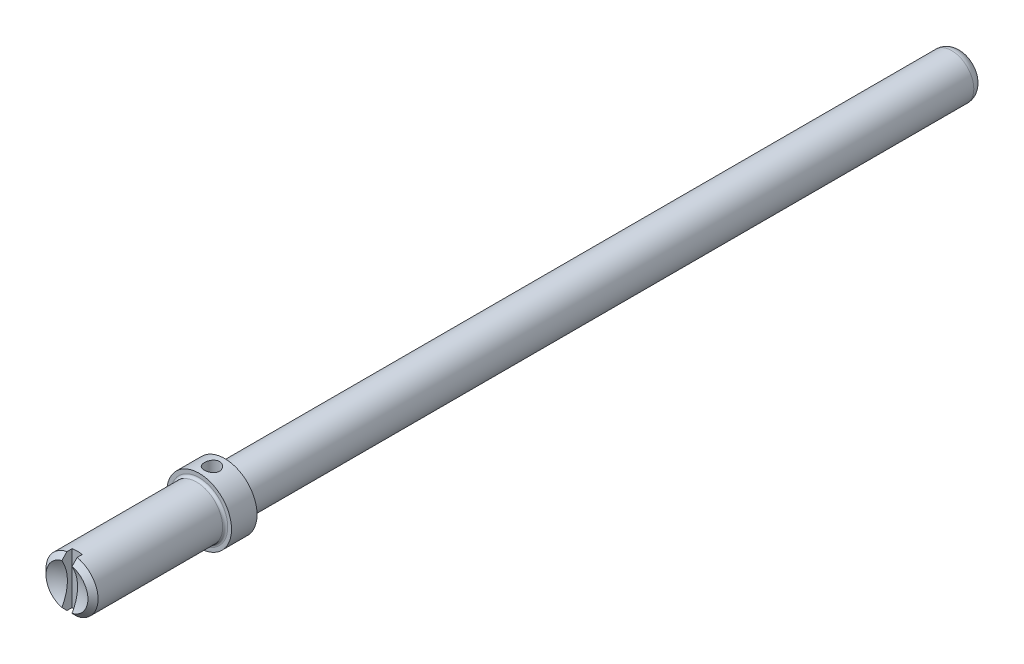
ISO-10303-21;
HEADER;
FILE_DESCRIPTION(('STEP AP214'),'2;1');
FILE_NAME('part.step','',(''),(''),'','','');
FILE_SCHEMA(('AUTOMOTIVE_DESIGN { 1 0 10303 214 1 1 1 1 }'));
ENDSEC;
DATA;
#1=APPLICATION_CONTEXT('core data for automotive mechanical design processes');
#2=APPLICATION_PROTOCOL_DEFINITION('international standard','automotive_design',2000,#1);
#3=PRODUCT_CONTEXT('',#1,'mechanical');
#4=PRODUCT('Part','Part','',(#3));
#5=PRODUCT_RELATED_PRODUCT_CATEGORY('part','',(#4));
#6=PRODUCT_DEFINITION_FORMATION('','',#4);
#7=PRODUCT_DEFINITION_CONTEXT('part definition',#1,'design');
#8=PRODUCT_DEFINITION('design','',#6,#7);
#9=PRODUCT_DEFINITION_SHAPE('','',#8);
#10=(LENGTH_UNIT() NAMED_UNIT(*) SI_UNIT(.MILLI.,.METRE.));
#11=(NAMED_UNIT(*) PLANE_ANGLE_UNIT() SI_UNIT($,.RADIAN.));
#12=(NAMED_UNIT(*) SI_UNIT($,.STERADIAN.) SOLID_ANGLE_UNIT());
#13=UNCERTAINTY_MEASURE_WITH_UNIT(LENGTH_MEASURE(1.E-05),#10,'distance_accuracy_value','');
#14=(GEOMETRIC_REPRESENTATION_CONTEXT(3) GLOBAL_UNCERTAINTY_ASSIGNED_CONTEXT((#13)) GLOBAL_UNIT_ASSIGNED_CONTEXT((#10,
#11,#12)) REPRESENTATION_CONTEXT('',''));
#15=CARTESIAN_POINT('',(0.,0.,0.));
#16=DIRECTION('',(0.,0.,1.));
#17=DIRECTION('',(1.,0.,0.));
#18=AXIS2_PLACEMENT_3D('',#15,#16,#17);
#19=CARTESIAN_POINT('',(0.,0.,0.113092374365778));
#20=DIRECTION('',(0.,0.,-1.));
#21=DIRECTION('',(-1.,0.,0.));
#22=AXIS2_PLACEMENT_3D('',#19,#20,#21);
#23=CONICAL_SURFACE('',#22,4.064,0.78539816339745);
#24=CARTESIAN_POINT('',(0.,0.,0.113092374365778));
#25=DIRECTION('',(0.,0.,1.));
#26=DIRECTION('',(1.,0.,0.));
#27=AXIS2_PLACEMENT_3D('',#24,#25,#26);
#28=CIRCLE('',#27,4.064);
#29=CARTESIAN_POINT('',(-0.79375,3.98573166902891,0.113092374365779));
#30=VERTEX_POINT('',#29);
#31=CARTESIAN_POINT('',(-0.79375,-3.98573166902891,0.113092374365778));
#32=VERTEX_POINT('',#31);
#33=EDGE_CURVE('E101',#30,#32,#28,.T.);
#34=ORIENTED_EDGE('',*,*,#33,.T.);
#35=CARTESIAN_POINT('',(-0.793749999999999,-8.92898810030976,-4.78710684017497));
#36=CARTESIAN_POINT('',(-0.793749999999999,-8.60900897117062,-4.46839600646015));
#37=CARTESIAN_POINT('',(-0.79375,-8.28897340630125,-4.14974175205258));
#38=CARTESIAN_POINT('',(-0.79375,-7.64868890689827,-3.51260359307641));
#39=CARTESIAN_POINT('',(-0.79375,-7.32843995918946,-3.19411970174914));
#40=CARTESIAN_POINT('',(-0.79375,-6.68714460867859,-2.55689909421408));
#41=CARTESIAN_POINT('',(-0.79375,-6.36609776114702,-2.2381628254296));
#42=CARTESIAN_POINT('',(-0.79375,-5.72360429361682,-1.60113642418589));
#43=CARTESIAN_POINT('',(-0.79375,-5.40215770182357,-1.28284626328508));
#44=CARTESIAN_POINT('',(-0.79375,-4.7791272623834,-0.667274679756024));
#45=CARTESIAN_POINT('',(-0.79375,-4.47758622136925,-0.369949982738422));
#46=CARTESIAN_POINT('',(-0.79375,-4.02442427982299,0.0752327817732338));
#47=CARTESIAN_POINT('',(-0.79375,-3.87321327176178,0.223507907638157));
#48=CARTESIAN_POINT('',(-0.79375,-3.57040511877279,0.519657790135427));
#49=CARTESIAN_POINT('',(-0.79375,-3.4188079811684,0.667532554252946));
#50=CARTESIAN_POINT('',(-0.79375,-3.11519891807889,0.962560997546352));
#51=CARTESIAN_POINT('',(-0.79375,-2.96318753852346,1.10971523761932));
#52=CARTESIAN_POINT('',(-0.79375,-2.65828988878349,1.40313706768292));
#53=CARTESIAN_POINT('',(-0.79375,-2.50540355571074,1.54940459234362));
#54=CARTESIAN_POINT('',(-0.79375,-2.19828604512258,1.840421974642));
#55=CARTESIAN_POINT('',(-0.79375,-2.04405535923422,1.9851723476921));
#56=CARTESIAN_POINT('',(-0.79375,-1.81078801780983,2.20019823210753));
#57=CARTESIAN_POINT('',(-0.79375,-1.73271661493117,2.27151949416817));
#58=CARTESIAN_POINT('',(-0.79375,-1.57564988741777,2.41313597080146));
#59=CARTESIAN_POINT('',(-0.79375,-1.49665460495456,2.48343123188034));
#60=CARTESIAN_POINT('',(-0.79375,-1.39468587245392,2.57238940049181));
#61=CARTESIAN_POINT('',(-0.79375,-1.37234208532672,2.59177431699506));
#62=CARTESIAN_POINT('',(-0.79375,-1.32753176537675,2.6304022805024));
#63=CARTESIAN_POINT('',(-0.79375,-1.30506523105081,2.64964532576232));
#64=CARTESIAN_POINT('',(-0.79375,-1.23745552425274,2.70713625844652));
#65=CARTESIAN_POINT('',(-0.79375,-1.19210609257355,2.74514257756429));
#66=CARTESIAN_POINT('',(-0.79375,-1.10017286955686,2.82072745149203));
#67=CARTESIAN_POINT('',(-0.793750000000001,-1.05358088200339,2.85829607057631));
#68=CARTESIAN_POINT('',(-0.793750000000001,-0.959449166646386,2.93221041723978));
#69=CARTESIAN_POINT('',(-0.793750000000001,-0.911909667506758,2.96855643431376));
#70=CARTESIAN_POINT('',(-0.793750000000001,-0.814905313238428,3.0399842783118));
#71=CARTESIAN_POINT('',(-0.793750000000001,-0.765423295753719,3.07504298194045));
#72=CARTESIAN_POINT('',(-0.793750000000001,-0.664577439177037,3.14254205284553));
#73=CARTESIAN_POINT('',(-0.793750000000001,-0.61321116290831,3.17497884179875));
#74=CARTESIAN_POINT('',(-0.793750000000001,-0.508651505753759,3.23530980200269));
#75=CARTESIAN_POINT('',(-0.793750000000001,-0.455487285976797,3.26325361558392));
#76=CARTESIAN_POINT('',(-0.793750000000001,-0.346184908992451,3.31249518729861));
#77=CARTESIAN_POINT('',(-0.793750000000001,-0.290057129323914,3.33381454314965));
#78=CARTESIAN_POINT('',(-0.793750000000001,-0.205980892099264,3.35744541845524));
#79=CARTESIAN_POINT('',(-0.793750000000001,-0.17917287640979,3.36380563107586));
#80=CARTESIAN_POINT('',(-0.793750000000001,-0.125071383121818,3.37398782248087));
#81=CARTESIAN_POINT('',(-0.793750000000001,-0.0977779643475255,3.37781010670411));
#82=CARTESIAN_POINT('',(-0.793750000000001,-0.043035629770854,3.38264169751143));
#83=CARTESIAN_POINT('',(-0.793750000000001,-0.0155876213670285,3.38366103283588));
#84=CARTESIAN_POINT('',(-0.793750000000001,0.0392602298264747,3.38284722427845));
#85=CARTESIAN_POINT('',(-0.793750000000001,0.0666600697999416,3.38101391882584));
#86=CARTESIAN_POINT('',(-0.793750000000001,0.147983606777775,3.37144138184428));
#87=CARTESIAN_POINT('',(-0.793750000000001,0.201462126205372,3.35966460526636));
#88=CARTESIAN_POINT('',(-0.793750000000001,0.279799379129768,3.33584980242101));
#89=CARTESIAN_POINT('',(-0.793750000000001,0.305683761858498,3.32684507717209));
#90=CARTESIAN_POINT('',(-0.793750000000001,0.356805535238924,3.30715121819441));
#91=CARTESIAN_POINT('',(-0.793750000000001,0.382043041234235,3.29646238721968));
#92=CARTESIAN_POINT('',(-0.793750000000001,0.453919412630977,3.26367776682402));
#93=CARTESIAN_POINT('',(-0.793750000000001,0.499761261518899,3.2398490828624));
#94=CARTESIAN_POINT('',(-0.793750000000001,0.589649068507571,3.18898605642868));
#95=CARTESIAN_POINT('',(-0.793750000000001,0.633692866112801,3.16194800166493));
#96=CARTESIAN_POINT('',(-0.793750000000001,0.72051132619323,3.10560663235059));
#97=CARTESIAN_POINT('',(-0.793750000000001,0.763281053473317,3.07629578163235));
#98=CARTESIAN_POINT('',(-0.793750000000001,0.847731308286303,3.01613807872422));
#99=CARTESIAN_POINT('',(-0.793750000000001,0.889411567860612,2.98529085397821));
#100=CARTESIAN_POINT('',(-0.793750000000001,1.01399754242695,2.89051862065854));
#101=CARTESIAN_POINT('',(-0.79375,1.09562742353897,2.82492159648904));
#102=CARTESIAN_POINT('',(-0.79375,1.21642156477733,2.72477133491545));
#103=CARTESIAN_POINT('',(-0.79375,1.25636516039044,2.69113603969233));
#104=CARTESIAN_POINT('',(-0.79375,1.33583062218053,2.62337187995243));
#105=CARTESIAN_POINT('',(-0.79375,1.37535250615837,2.58924303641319));
#106=CARTESIAN_POINT('',(-0.79375,1.49170376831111,2.48777476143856));
#107=CARTESIAN_POINT('',(-0.79375,1.56805956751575,2.41989356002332));
#108=CARTESIAN_POINT('',(-0.79375,1.71989401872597,2.28315505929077));
#109=CARTESIAN_POINT('',(-0.79375,1.79537263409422,2.21429771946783));
#110=CARTESIAN_POINT('',(-0.79375,2.02090172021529,2.00670485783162));
#111=CARTESIAN_POINT('',(-0.79375,2.17002653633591,1.86696527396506));
#112=CARTESIAN_POINT('',(-0.79375,2.46709271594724,1.58588992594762));
#113=CARTESIAN_POINT('',(-0.79375,2.61503245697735,1.4445524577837));
#114=CARTESIAN_POINT('',(-0.79375,2.91005209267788,1.16100501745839));
#115=CARTESIAN_POINT('',(-0.79375,3.05713204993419,1.01879511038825));
#116=CARTESIAN_POINT('',(-0.79375,3.34938945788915,0.735111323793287));
#117=CARTESIAN_POINT('',(-0.79375,3.494571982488,0.593642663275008));
#118=CARTESIAN_POINT('',(-0.79375,3.78455928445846,0.310313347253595));
#119=CARTESIAN_POINT('',(-0.79375,3.92936405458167,0.168452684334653));
#120=CARTESIAN_POINT('',(-0.79375,4.36324671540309,-0.257416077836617));
#121=CARTESIAN_POINT('',(-0.79375,4.65192075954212,-0.541835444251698));
#122=CARTESIAN_POINT('',(-0.79375,5.27203658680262,-1.15410662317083));
#123=CARTESIAN_POINT('',(-0.79375,5.60338083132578,-1.48205710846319));
#124=CARTESIAN_POINT('',(-0.79375,6.26564923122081,-2.13848281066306));
#125=CARTESIAN_POINT('',(-0.79375,6.59657331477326,-2.46695810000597));
#126=CARTESIAN_POINT('',(-0.79375,7.26122311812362,-3.12728638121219));
#127=CARTESIAN_POINT('',(-0.79375,7.59494604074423,-3.4591421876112));
#128=CARTESIAN_POINT('',(-0.79375,8.26212859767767,-4.12301430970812));
#129=CARTESIAN_POINT('',(-0.79375,8.59558826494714,-4.455030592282));
#130=CARTESIAN_POINT('',(-0.793749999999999,8.92898810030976,-4.78710684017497));
#131=B_SPLINE_CURVE_WITH_KNOTS('',3,(#35,#36,#37,#38,#39,#40,#41,#42,#43,#44,#45,#46,#47,#48,
#49,#50,#51,#52,#53,#54,#55,#56,#57,#58,#59,#60,#61,#62,#63,#64,#65,#66,#67,#68,#69,#70,#71,#72,
#73,#74,#75,#76,#77,#78,#79,#80,#81,#82,#83,#84,#85,#86,#87,#88,#89,#90,#91,#92,#93,#94,#95,#96,
#97,#98,#99,#100,#101,#102,#103,#104,#105,#106,#107,#108,#109,#110,#111,#112,#113,#114,#115,
#116,#117,#118,#119,#120,#121,#122,#123,#124,#125,#126,#127,#128,#129,#130),.UNSPECIFIED.,.F.,
.F.,(4,2,2,2,2,2,2,2,2,2,2,2,2,2,2,2,2,2,2,2,2,2,2,2,2,2,2,2,2,2,2,2,2,2,2,2,2,2,2,2,2,2,2,2,2,
2,2,4),(0.,1.35486875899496,2.70983081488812,4.06702432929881,5.42412697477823,6.69454262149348,
7.32987864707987,7.9652027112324,8.59990966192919,9.23466282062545,9.86919285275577,
10.186420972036,10.5036346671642,10.5923763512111,10.6811191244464,10.8586199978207,
11.0381607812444,11.2176587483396,11.3995344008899,11.5816542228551,11.7615981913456,
11.9409491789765,12.0235036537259,12.1060481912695,12.1882970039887,12.2705504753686,
12.4337851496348,12.5159673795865,12.5981348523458,12.7529164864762,12.9078789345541,
13.0633791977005,13.2189173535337,13.5329681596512,13.689625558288,13.8462763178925,
14.1527632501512,14.4592629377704,15.0723381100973,15.6861440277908,16.2999046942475,
16.9080338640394,17.5161746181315,18.7319208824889,20.1305141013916,21.5293207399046,
22.941231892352,24.3529227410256),.UNSPECIFIED.);
#132=CARTESIAN_POINT('',(-0.79375,-3.17245898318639,0.906842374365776));
#133=VERTEX_POINT('',#132);
#134=EDGE_CURVE('E60',#32,#133,#131,.T.);
#135=ORIENTED_EDGE('',*,*,#134,.T.);
#136=CARTESIAN_POINT('',(0.,0.,0.906842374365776));
#137=DIRECTION('',(0.,0.,1.));
#138=DIRECTION('',(1.,0.,0.));
#139=AXIS2_PLACEMENT_3D('',#136,#137,#138);
#140=CIRCLE('',#139,3.27025);
#141=CARTESIAN_POINT('',(-0.79375,3.17245898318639,0.906842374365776));
#142=VERTEX_POINT('',#141);
#143=EDGE_CURVE('E99',#142,#133,#140,.T.);
#144=ORIENTED_EDGE('',*,*,#143,.F.);
#145=EDGE_CURVE('E92',#142,#30,#131,.T.);
#146=ORIENTED_EDGE('',*,*,#145,.T.);
#147=EDGE_LOOP('',(#34,#135,#144,#146));
#148=FACE_BOUND('',#147,.T.);
#149=ADVANCED_FACE('F37',(#148),#23,.T.);
#150=CARTESIAN_POINT('',(0.,0.,6.35));
#151=DIRECTION('',(0.,0.,1.));
#152=DIRECTION('',(0.,1.,0.));
#153=AXIS2_PLACEMENT_3D('',#150,#151,#152);
#154=SPHERICAL_SURFACE('',#153,6.35);
#155=ORIENTED_EDGE('',*,*,#143,.T.);
#156=CARTESIAN_POINT('',(-0.793750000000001,0.,6.35));
#157=DIRECTION('',(-1.,0.,0.));
#158=DIRECTION('',(0.,0.,1.));
#159=AXIS2_PLACEMENT_3D('',#156,#157,#158);
#160=CIRCLE('',#159,6.30019530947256);
#161=EDGE_CURVE('E88',#133,#142,#160,.F.);
#162=ORIENTED_EDGE('',*,*,#161,.T.);
#163=EDGE_LOOP('',(#155,#162));
#164=FACE_BOUND('',#163,.T.);
#165=ADVANCED_FACE('F104',(#164),#154,.F.);
#166=CARTESIAN_POINT('',(0.,1.86689999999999,-138.793157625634));
#167=DIRECTION('',(0.,0.,1.));
#168=DIRECTION('',(1.,0.,0.));
#169=AXIS2_PLACEMENT_3D('',#166,#167,#168);
#170=PLANE('',#169);
#171=CARTESIAN_POINT('',(0.,0.,-138.793157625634));
#172=DIRECTION('',(0.,0.,1.));
#173=DIRECTION('',(1.,0.,0.));
#174=AXIS2_PLACEMENT_3D('',#171,#172,#173);
#175=CIRCLE('',#174,1.86689999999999);
#176=CARTESIAN_POINT('',(1.86689999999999,0.,-138.793157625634));
#177=VERTEX_POINT('',#176);
#178=EDGE_CURVE('E137',#177,#177,#175,.T.);
#179=ORIENTED_EDGE('',*,*,#178,.F.);
#180=EDGE_LOOP('',(#179));
#181=FACE_BOUND('',#180,.T.);
#182=ADVANCED_FACE('F39',(#181),#170,.F.);
#183=CARTESIAN_POINT('',(0.,0.,-137.205657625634));
#184=DIRECTION('',(0.,0.,1.));
#185=DIRECTION('',(1.,0.,0.));
#186=AXIS2_PLACEMENT_3D('',#183,#184,#185);
#187=TOROIDAL_SURFACE('',#186,1.8669,1.5875);
#188=CARTESIAN_POINT('',(0.,0.,-137.205657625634));
#189=DIRECTION('',(0.,0.,1.));
#190=DIRECTION('',(1.,0.,0.));
#191=AXIS2_PLACEMENT_3D('',#188,#189,#190);
#192=CIRCLE('',#191,3.4544);
#193=CARTESIAN_POINT('',(3.4544,0.,-137.205657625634));
#194=VERTEX_POINT('',#193);
#195=EDGE_CURVE('E134',#194,#194,#192,.T.);
#196=ORIENTED_EDGE('',*,*,#195,.F.);
#197=EDGE_LOOP('',(#196));
#198=FACE_BOUND('',#197,.T.);
#199=ORIENTED_EDGE('',*,*,#178,.T.);
#200=EDGE_LOOP('',(#199));
#201=FACE_BOUND('',#200,.T.);
#202=ADVANCED_FACE('F219',(#198,#201),#187,.T.);
#203=CARTESIAN_POINT('',(0.,0.,11.6873656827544));
#204=DIRECTION('',(0.,0.,1.));
#205=DIRECTION('',(1.,0.,0.));
#206=AXIS2_PLACEMENT_3D('',#203,#204,#205);
#207=CYLINDRICAL_SURFACE('',#206,3.4544);
#208=CARTESIAN_POINT('',(0.,0.,-24.1153326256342));
#209=DIRECTION('',(0.,0.,1.));
#210=DIRECTION('',(1.,0.,0.));
#211=AXIS2_PLACEMENT_3D('',#208,#209,#210);
#212=CIRCLE('',#211,3.4544);
#213=CARTESIAN_POINT('',(3.4544,0.,-24.1153326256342));
#214=VERTEX_POINT('',#213);
#215=EDGE_CURVE('E131',#214,#214,#212,.T.);
#216=ORIENTED_EDGE('',*,*,#215,.F.);
#217=EDGE_LOOP('',(#216));
#218=FACE_BOUND('',#217,.T.);
#219=ORIENTED_EDGE('',*,*,#195,.T.);
#220=EDGE_LOOP('',(#219));
#221=FACE_BOUND('',#220,.T.);
#222=ADVANCED_FACE('F224',(#218,#221),#207,.T.);
#223=CARTESIAN_POINT('',(0.,0.,-24.1153326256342));
#224=DIRECTION('',(0.,0.,1.));
#225=DIRECTION('',(1.,0.,0.));
#226=AXIS2_PLACEMENT_3D('',#223,#224,#225);
#227=TOROIDAL_SURFACE('',#226,3.851275,0.396875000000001);
#228=CARTESIAN_POINT('',(0.,0.,-23.7184576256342));
#229=DIRECTION('',(0.,0.,1.));
#230=DIRECTION('',(1.,0.,0.));
#231=AXIS2_PLACEMENT_3D('',#228,#229,#230);
#232=CIRCLE('',#231,3.851275);
#233=CARTESIAN_POINT('',(3.851275,0.,-23.7184576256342));
#234=VERTEX_POINT('',#233);
#235=EDGE_CURVE('E128',#234,#234,#232,.T.);
#236=ORIENTED_EDGE('',*,*,#235,.F.);
#237=EDGE_LOOP('',(#236));
#238=FACE_BOUND('',#237,.T.);
#239=ORIENTED_EDGE('',*,*,#215,.T.);
#240=EDGE_LOOP('',(#239));
#241=FACE_BOUND('',#240,.T.);
#242=ADVANCED_FACE('F231',(#238,#241),#227,.F.);
#243=CARTESIAN_POINT('',(0.,5.0546,-23.7184576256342));
#244=DIRECTION('',(0.,0.,1.));
#245=DIRECTION('',(1.,0.,0.));
#246=AXIS2_PLACEMENT_3D('',#243,#244,#245);
#247=PLANE('',#246);
#248=CARTESIAN_POINT('',(0.,0.,-23.7184576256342));
#249=DIRECTION('',(0.,0.,1.));
#250=DIRECTION('',(1.,0.,0.));
#251=AXIS2_PLACEMENT_3D('',#248,#249,#250);
#252=CIRCLE('',#251,5.0546);
#253=CARTESIAN_POINT('',(5.0546,0.,-23.7184576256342));
#254=VERTEX_POINT('',#253);
#255=EDGE_CURVE('E125',#254,#254,#252,.T.);
#256=ORIENTED_EDGE('',*,*,#255,.F.);
#257=EDGE_LOOP('',(#256));
#258=FACE_BOUND('',#257,.T.);
#259=ORIENTED_EDGE('',*,*,#235,.T.);
#260=EDGE_LOOP('',(#259));
#261=FACE_BOUND('',#260,.T.);
#262=ADVANCED_FACE('F237',(#258,#261),#247,.F.);
#263=CARTESIAN_POINT('',(0.,0.,11.6873656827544));
#264=DIRECTION('',(0.,0.,1.));
#265=DIRECTION('',(1.,0.,0.));
#266=AXIS2_PLACEMENT_3D('',#263,#264,#265);
#267=CYLINDRICAL_SURFACE('',#266,5.0546);
#268=CARTESIAN_POINT('',(0.,-5.0546,-20.5434576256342));
#269=CARTESIAN_POINT('',(0.0653911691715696,-5.05459882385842,-20.5434596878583));
#270=CARTESIAN_POINT('',(0.130806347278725,-5.05331827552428,-20.5489064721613));
#271=CARTESIAN_POINT('',(0.25977085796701,-5.04833377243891,-20.5705224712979));
#272=CARTESIAN_POINT('',(0.323318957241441,-5.0446282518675,-20.5866986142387));
#273=CARTESIAN_POINT('',(0.446667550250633,-5.03520534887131,-20.6292328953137));
#274=CARTESIAN_POINT('',(0.506472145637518,-5.02949021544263,-20.6555796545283));
#275=CARTESIAN_POINT('',(0.620811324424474,-5.0166611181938,-20.717669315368));
#276=CARTESIAN_POINT('',(0.675345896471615,-5.00954715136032,-20.7534122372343));
#277=CARTESIAN_POINT('',(0.778588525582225,-4.99455201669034,-20.8339660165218));
#278=CARTESIAN_POINT('',(0.827187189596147,-4.98666023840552,-20.8789151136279));
#279=CARTESIAN_POINT('',(0.916228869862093,-4.97107168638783,-20.97630889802));
#280=CARTESIAN_POINT('',(0.956671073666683,-4.96337493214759,-21.0287543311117));
#281=CARTESIAN_POINT('',(1.02874913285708,-4.94894223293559,-21.1404796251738));
#282=CARTESIAN_POINT('',(1.06026580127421,-4.94221982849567,-21.1998382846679));
#283=CARTESIAN_POINT('',(1.11283273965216,-4.93065044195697,-21.3231929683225));
#284=CARTESIAN_POINT('',(1.13388445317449,-4.92580320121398,-21.3871883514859));
#285=CARTESIAN_POINT('',(1.16455695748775,-4.91864151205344,-21.5168055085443));
#286=CARTESIAN_POINT('',(1.174372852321,-4.9162838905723,-21.5823786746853));
#287=CARTESIAN_POINT('',(1.18290224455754,-4.91423892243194,-21.7142801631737));
#288=CARTESIAN_POINT('',(1.18161730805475,-4.91455119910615,-21.780608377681));
#289=CARTESIAN_POINT('',(1.16813789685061,-4.91777178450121,-21.910666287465));
#290=CARTESIAN_POINT('',(1.15617272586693,-4.92062552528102,-21.9744213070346));
#291=CARTESIAN_POINT('',(1.12203693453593,-4.92852090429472,-22.098993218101));
#292=CARTESIAN_POINT('',(1.0998656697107,-4.93356268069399,-22.1598099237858));
#293=CARTESIAN_POINT('',(1.0457435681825,-4.94531810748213,-22.2774096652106));
#294=CARTESIAN_POINT('',(1.01370686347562,-4.95204633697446,-22.3341516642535));
#295=CARTESIAN_POINT('',(0.940823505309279,-4.96640796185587,-22.4415380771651));
#296=CARTESIAN_POINT('',(0.899975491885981,-4.97404149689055,-22.4921815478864));
#297=CARTESIAN_POINT('',(0.809427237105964,-4.98958575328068,-22.5872507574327));
#298=CARTESIAN_POINT('',(0.759532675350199,-4.99749865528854,-22.6314912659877));
#299=CARTESIAN_POINT('',(0.65294029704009,-5.0125385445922,-22.711009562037));
#300=CARTESIAN_POINT('',(0.5962423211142,-5.01966551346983,-22.7462871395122));
#301=CARTESIAN_POINT('',(0.477408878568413,-5.03235904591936,-22.8069340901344));
#302=CARTESIAN_POINT('',(0.415259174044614,-5.03792135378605,-22.8322765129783));
#303=CARTESIAN_POINT('',(0.28742379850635,-5.04682759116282,-22.8721049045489));
#304=CARTESIAN_POINT('',(0.221738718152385,-5.0501718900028,-22.8865926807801));
#305=CARTESIAN_POINT('',(0.0902835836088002,-5.05421176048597,-22.9040249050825));
#306=CARTESIAN_POINT('',(0.02454876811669,-5.05496529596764,-22.9072220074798));
#307=CARTESIAN_POINT('',(-0.106515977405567,-5.05390239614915,-22.9026707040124));
#308=CARTESIAN_POINT('',(-0.171845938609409,-5.05208616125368,-22.8949231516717));
#309=CARTESIAN_POINT('',(-0.299390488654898,-5.04612464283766,-22.8689114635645));
#310=CARTESIAN_POINT('',(-0.361634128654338,-5.04200926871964,-22.8507823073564));
#311=CARTESIAN_POINT('',(-0.482195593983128,-5.03191132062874,-22.8046738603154));
#312=CARTESIAN_POINT('',(-0.540513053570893,-5.02592857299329,-22.7766936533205));
#313=CARTESIAN_POINT('',(-0.652593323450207,-5.01261826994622,-22.7111680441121));
#314=CARTESIAN_POINT('',(-0.706268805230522,-5.00527081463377,-22.6734774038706));
#315=CARTESIAN_POINT('',(-0.806623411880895,-4.9900821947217,-22.5897894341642));
#316=CARTESIAN_POINT('',(-0.853301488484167,-4.98224095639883,-22.5437908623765));
#317=CARTESIAN_POINT('',(-0.939354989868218,-4.96674433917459,-22.4436265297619));
#318=CARTESIAN_POINT('',(-0.978554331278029,-4.95909644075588,-22.3893081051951));
#319=CARTESIAN_POINT('',(-1.04727747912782,-4.94504057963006,-22.2747122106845));
#320=CARTESIAN_POINT('',(-1.07680171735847,-4.93863256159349,-22.2144350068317));
#321=CARTESIAN_POINT('',(-1.12512529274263,-4.92784817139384,-22.0899617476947));
#322=CARTESIAN_POINT('',(-1.14398731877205,-4.92345995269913,-22.025791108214));
#323=CARTESIAN_POINT('',(-1.17062740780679,-4.91719466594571,-21.8950735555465));
#324=CARTESIAN_POINT('',(-1.17840753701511,-4.91531712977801,-21.8285270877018));
#325=CARTESIAN_POINT('',(-1.18256558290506,-4.91431819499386,-21.696729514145));
#326=CARTESIAN_POINT('',(-1.17922365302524,-4.91512907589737,-21.631487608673));
#327=CARTESIAN_POINT('',(-1.16186562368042,-4.91926087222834,-21.5025247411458));
#328=CARTESIAN_POINT('',(-1.14784968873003,-4.92258174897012,-21.4388037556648));
#329=CARTESIAN_POINT('',(-1.10968527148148,-4.93132410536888,-21.3149520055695));
#330=CARTESIAN_POINT('',(-1.0855830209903,-4.93673599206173,-21.2548062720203));
#331=CARTESIAN_POINT('',(-1.02796801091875,-4.94905313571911,-21.139372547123));
#332=CARTESIAN_POINT('',(-0.994454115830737,-4.95595857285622,-21.0840851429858));
#333=CARTESIAN_POINT('',(-0.918061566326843,-4.97068280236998,-20.9785688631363));
#334=CARTESIAN_POINT('',(-0.874985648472,-4.97851891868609,-20.9284851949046));
#335=CARTESIAN_POINT('',(-0.781084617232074,-4.99411142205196,-20.8361657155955));
#336=CARTESIAN_POINT('',(-0.730257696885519,-5.00186779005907,-20.793931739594));
#337=CARTESIAN_POINT('',(-0.621361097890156,-5.01656780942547,-20.7178873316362));
#338=CARTESIAN_POINT('',(-0.563192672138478,-5.02349724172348,-20.6842153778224));
#339=CARTESIAN_POINT('',(-0.441868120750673,-5.03561690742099,-20.6271810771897));
#340=CARTESIAN_POINT('',(-0.378715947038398,-5.04080850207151,-20.6038106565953));
#341=CARTESIAN_POINT('',(-0.262981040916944,-5.04801372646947,-20.5718900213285));
#342=CARTESIAN_POINT('',(-0.21099212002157,-5.05046752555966,-20.561249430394));
#343=CARTESIAN_POINT('',(-0.106007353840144,-5.05376109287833,-20.5470325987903));
#344=CARTESIAN_POINT('',(-0.0530115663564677,-5.05460095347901,-20.5434559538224));
#345=CARTESIAN_POINT('',(0.,-5.0546,-20.5434576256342));
#346=B_SPLINE_CURVE_WITH_KNOTS('',3,(#268,#269,#270,#271,#272,#273,#274,#275,#276,#277,#278,
#279,#280,#281,#282,#283,#284,#285,#286,#287,#288,#289,#290,#291,#292,#293,#294,#295,#296,#297,
#298,#299,#300,#301,#302,#303,#304,#305,#306,#307,#308,#309,#310,#311,#312,#313,#314,#315,#316,
#317,#318,#319,#320,#321,#322,#323,#324,#325,#326,#327,#328,#329,#330,#331,#332,#333,#334,#335,
#336,#337,#338,#339,#340,#341,#342,#343,#344,#345),.UNSPECIFIED.,.T.,.F.,(4,2,2,2,2,2,2,2,2,2,2,
2,2,2,2,2,2,2,2,2,2,2,2,2,2,2,2,2,2,2,2,2,2,2,2,2,2,2,4),(0.,0.195979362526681,
0.392085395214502,0.58797265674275,0.783860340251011,0.9829392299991,1.1820379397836,
1.38368186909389,1.58529797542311,1.78335732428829,1.98138873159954,2.1752680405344,
2.369159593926,2.56478889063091,2.76044840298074,2.96095764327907,3.16147158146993,
3.36252573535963,3.56354640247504,3.76003923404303,3.95651674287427,4.15049588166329,
4.3444930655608,4.54157983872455,4.73869610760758,4.93999735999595,5.1412896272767,
5.3413857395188,5.541444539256,5.73650258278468,5.93155762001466,6.12572822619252,
6.31992226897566,6.51857291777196,6.71726994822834,6.91900113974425,7.12057394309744,
7.27946034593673,7.4383376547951),.UNSPECIFIED.);
#347=CARTESIAN_POINT('',(0.,-5.0546,-20.5434576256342));
#348=VERTEX_POINT('',#347);
#349=EDGE_CURVE('E111',#348,#348,#346,.T.);
#350=ORIENTED_EDGE('',*,*,#349,.T.);
#351=EDGE_LOOP('',(#350));
#352=FACE_BOUND('',#351,.T.);
#353=CARTESIAN_POINT('',(0.,5.0546,-20.5434576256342));
#354=CARTESIAN_POINT('',(-0.0653911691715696,5.05459882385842,-20.5434596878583));
#355=CARTESIAN_POINT('',(-0.130806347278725,5.05331827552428,-20.5489064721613));
#356=CARTESIAN_POINT('',(-0.25977085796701,5.04833377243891,-20.5705224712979));
#357=CARTESIAN_POINT('',(-0.323318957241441,5.0446282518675,-20.5866986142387));
#358=CARTESIAN_POINT('',(-0.446667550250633,5.03520534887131,-20.6292328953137));
#359=CARTESIAN_POINT('',(-0.506472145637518,5.02949021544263,-20.6555796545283));
#360=CARTESIAN_POINT('',(-0.620811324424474,5.0166611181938,-20.717669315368));
#361=CARTESIAN_POINT('',(-0.675345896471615,5.00954715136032,-20.7534122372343));
#362=CARTESIAN_POINT('',(-0.778588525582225,4.99455201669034,-20.8339660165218));
#363=CARTESIAN_POINT('',(-0.827187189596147,4.98666023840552,-20.8789151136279));
#364=CARTESIAN_POINT('',(-0.916228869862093,4.97107168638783,-20.97630889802));
#365=CARTESIAN_POINT('',(-0.956671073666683,4.96337493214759,-21.0287543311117));
#366=CARTESIAN_POINT('',(-1.02874913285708,4.94894223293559,-21.1404796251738));
#367=CARTESIAN_POINT('',(-1.06026580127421,4.94221982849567,-21.1998382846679));
#368=CARTESIAN_POINT('',(-1.11283273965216,4.93065044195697,-21.3231929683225));
#369=CARTESIAN_POINT('',(-1.13388445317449,4.92580320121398,-21.3871883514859));
#370=CARTESIAN_POINT('',(-1.16455695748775,4.91864151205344,-21.5168055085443));
#371=CARTESIAN_POINT('',(-1.174372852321,4.9162838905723,-21.5823786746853));
#372=CARTESIAN_POINT('',(-1.18290224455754,4.91423892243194,-21.7142801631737));
#373=CARTESIAN_POINT('',(-1.18161730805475,4.91455119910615,-21.780608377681));
#374=CARTESIAN_POINT('',(-1.16813789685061,4.91777178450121,-21.910666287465));
#375=CARTESIAN_POINT('',(-1.15617272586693,4.92062552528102,-21.9744213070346));
#376=CARTESIAN_POINT('',(-1.12203693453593,4.92852090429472,-22.098993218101));
#377=CARTESIAN_POINT('',(-1.0998656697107,4.93356268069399,-22.1598099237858));
#378=CARTESIAN_POINT('',(-1.0457435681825,4.94531810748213,-22.2774096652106));
#379=CARTESIAN_POINT('',(-1.01370686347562,4.95204633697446,-22.3341516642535));
#380=CARTESIAN_POINT('',(-0.940823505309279,4.96640796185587,-22.4415380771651));
#381=CARTESIAN_POINT('',(-0.899975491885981,4.97404149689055,-22.4921815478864));
#382=CARTESIAN_POINT('',(-0.809427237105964,4.98958575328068,-22.5872507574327));
#383=CARTESIAN_POINT('',(-0.759532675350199,4.99749865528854,-22.6314912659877));
#384=CARTESIAN_POINT('',(-0.65294029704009,5.0125385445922,-22.711009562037));
#385=CARTESIAN_POINT('',(-0.5962423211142,5.01966551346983,-22.7462871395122));
#386=CARTESIAN_POINT('',(-0.477408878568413,5.03235904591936,-22.8069340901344));
#387=CARTESIAN_POINT('',(-0.415259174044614,5.03792135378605,-22.8322765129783));
#388=CARTESIAN_POINT('',(-0.28742379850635,5.04682759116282,-22.8721049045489));
#389=CARTESIAN_POINT('',(-0.221738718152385,5.0501718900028,-22.8865926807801));
#390=CARTESIAN_POINT('',(-0.0902835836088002,5.05421176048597,-22.9040249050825));
#391=CARTESIAN_POINT('',(-0.02454876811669,5.05496529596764,-22.9072220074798));
#392=CARTESIAN_POINT('',(0.106515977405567,5.05390239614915,-22.9026707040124));
#393=CARTESIAN_POINT('',(0.171845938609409,5.05208616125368,-22.8949231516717));
#394=CARTESIAN_POINT('',(0.299390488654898,5.04612464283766,-22.8689114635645));
#395=CARTESIAN_POINT('',(0.361634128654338,5.04200926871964,-22.8507823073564));
#396=CARTESIAN_POINT('',(0.482195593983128,5.03191132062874,-22.8046738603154));
#397=CARTESIAN_POINT('',(0.540513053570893,5.02592857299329,-22.7766936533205));
#398=CARTESIAN_POINT('',(0.652593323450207,5.01261826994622,-22.7111680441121));
#399=CARTESIAN_POINT('',(0.706268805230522,5.00527081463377,-22.6734774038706));
#400=CARTESIAN_POINT('',(0.806623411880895,4.9900821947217,-22.5897894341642));
#401=CARTESIAN_POINT('',(0.853301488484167,4.98224095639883,-22.5437908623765));
#402=CARTESIAN_POINT('',(0.939354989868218,4.96674433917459,-22.4436265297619));
#403=CARTESIAN_POINT('',(0.978554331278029,4.95909644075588,-22.3893081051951));
#404=CARTESIAN_POINT('',(1.04727747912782,4.94504057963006,-22.2747122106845));
#405=CARTESIAN_POINT('',(1.07680171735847,4.93863256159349,-22.2144350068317));
#406=CARTESIAN_POINT('',(1.12512529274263,4.92784817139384,-22.0899617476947));
#407=CARTESIAN_POINT('',(1.14398731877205,4.92345995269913,-22.025791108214));
#408=CARTESIAN_POINT('',(1.17062740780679,4.91719466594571,-21.8950735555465));
#409=CARTESIAN_POINT('',(1.17840753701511,4.91531712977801,-21.8285270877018));
#410=CARTESIAN_POINT('',(1.18256558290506,4.91431819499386,-21.696729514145));
#411=CARTESIAN_POINT('',(1.17922365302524,4.91512907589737,-21.631487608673));
#412=CARTESIAN_POINT('',(1.16186562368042,4.91926087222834,-21.5025247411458));
#413=CARTESIAN_POINT('',(1.14784968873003,4.92258174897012,-21.4388037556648));
#414=CARTESIAN_POINT('',(1.10968527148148,4.93132410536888,-21.3149520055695));
#415=CARTESIAN_POINT('',(1.0855830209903,4.93673599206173,-21.2548062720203));
#416=CARTESIAN_POINT('',(1.02796801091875,4.94905313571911,-21.139372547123));
#417=CARTESIAN_POINT('',(0.994454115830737,4.95595857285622,-21.0840851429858));
#418=CARTESIAN_POINT('',(0.918061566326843,4.97068280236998,-20.9785688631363));
#419=CARTESIAN_POINT('',(0.874985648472,4.97851891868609,-20.9284851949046));
#420=CARTESIAN_POINT('',(0.781084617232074,4.99411142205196,-20.8361657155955));
#421=CARTESIAN_POINT('',(0.730257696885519,5.00186779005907,-20.793931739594));
#422=CARTESIAN_POINT('',(0.621361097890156,5.01656780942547,-20.7178873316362));
#423=CARTESIAN_POINT('',(0.563192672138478,5.02349724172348,-20.6842153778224));
#424=CARTESIAN_POINT('',(0.441868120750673,5.03561690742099,-20.6271810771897));
#425=CARTESIAN_POINT('',(0.378715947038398,5.04080850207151,-20.6038106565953));
#426=CARTESIAN_POINT('',(0.262981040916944,5.04801372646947,-20.5718900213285));
#427=CARTESIAN_POINT('',(0.21099212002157,5.05046752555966,-20.561249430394));
#428=CARTESIAN_POINT('',(0.106007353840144,5.05376109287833,-20.5470325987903));
#429=CARTESIAN_POINT('',(0.0530115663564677,5.05460095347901,-20.5434559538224));
#430=CARTESIAN_POINT('',(0.,5.0546,-20.5434576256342));
#431=B_SPLINE_CURVE_WITH_KNOTS('',3,(#353,#354,#355,#356,#357,#358,#359,#360,#361,#362,#363,
#364,#365,#366,#367,#368,#369,#370,#371,#372,#373,#374,#375,#376,#377,#378,#379,#380,#381,#382,
#383,#384,#385,#386,#387,#388,#389,#390,#391,#392,#393,#394,#395,#396,#397,#398,#399,#400,#401,
#402,#403,#404,#405,#406,#407,#408,#409,#410,#411,#412,#413,#414,#415,#416,#417,#418,#419,#420,
#421,#422,#423,#424,#425,#426,#427,#428,#429,#430),.UNSPECIFIED.,.T.,.F.,(4,2,2,2,2,2,2,2,2,2,2,
2,2,2,2,2,2,2,2,2,2,2,2,2,2,2,2,2,2,2,2,2,2,2,2,2,2,2,4),(0.,0.195979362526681,
0.392085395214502,0.58797265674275,0.783860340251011,0.9829392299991,1.1820379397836,
1.38368186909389,1.58529797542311,1.78335732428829,1.98138873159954,2.1752680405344,
2.369159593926,2.56478889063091,2.76044840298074,2.96095764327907,3.16147158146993,
3.36252573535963,3.56354640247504,3.76003923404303,3.95651674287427,4.15049588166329,
4.3444930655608,4.54157983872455,4.73869610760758,4.93999735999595,5.1412896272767,
5.3413857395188,5.541444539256,5.73650258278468,5.93155762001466,6.12572822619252,
6.31992226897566,6.51857291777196,6.71726994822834,6.91900113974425,7.12057394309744,
7.27946034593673,7.4383376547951),.UNSPECIFIED.);
#432=CARTESIAN_POINT('',(0.,5.0546,-20.5434576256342));
#433=VERTEX_POINT('',#432);
#434=EDGE_CURVE('E140',#433,#433,#431,.T.);
#435=ORIENTED_EDGE('',*,*,#434,.T.);
#436=EDGE_LOOP('',(#435));
#437=FACE_BOUND('',#436,.T.);
#438=CARTESIAN_POINT('',(0.,0.,-19.7306576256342));
#439=DIRECTION('',(0.,0.,1.));
#440=DIRECTION('',(1.,0.,0.));
#441=AXIS2_PLACEMENT_3D('',#438,#439,#440);
#442=CIRCLE('',#441,5.0546);
#443=CARTESIAN_POINT('',(5.0546,0.,-19.7306576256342));
#444=VERTEX_POINT('',#443);
#445=EDGE_CURVE('E122',#444,#444,#442,.T.);
#446=ORIENTED_EDGE('',*,*,#445,.F.);
#447=EDGE_LOOP('',(#446));
#448=FACE_BOUND('',#447,.T.);
#449=ORIENTED_EDGE('',*,*,#255,.T.);
#450=EDGE_LOOP('',(#449));
#451=FACE_BOUND('',#450,.T.);
#452=ADVANCED_FACE('F150',(#352,#437,#448,#451),#267,.T.);
#453=CARTESIAN_POINT('',(0.,4.46087500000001,-19.7306576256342));
#454=DIRECTION('',(0.,0.,-1.));
#455=DIRECTION('',(-1.,0.,0.));
#456=AXIS2_PLACEMENT_3D('',#453,#454,#455);
#457=PLANE('',#456);
#458=CARTESIAN_POINT('',(0.,0.,-19.7306576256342));
#459=DIRECTION('',(0.,0.,1.));
#460=DIRECTION('',(1.,0.,0.));
#461=AXIS2_PLACEMENT_3D('',#458,#459,#460);
#462=CIRCLE('',#461,4.46087500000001);
#463=CARTESIAN_POINT('',(4.46087500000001,0.,-19.7306576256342));
#464=VERTEX_POINT('',#463);
#465=EDGE_CURVE('E119',#464,#464,#462,.T.);
#466=ORIENTED_EDGE('',*,*,#465,.F.);
#467=EDGE_LOOP('',(#466));
#468=FACE_BOUND('',#467,.T.);
#469=ORIENTED_EDGE('',*,*,#445,.T.);
#470=EDGE_LOOP('',(#469));
#471=FACE_BOUND('',#470,.T.);
#472=ADVANCED_FACE('F244',(#468,#471),#457,.F.);
#473=CARTESIAN_POINT('',(0.,0.,-19.3337826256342));
#474=DIRECTION('',(0.,0.,1.));
#475=DIRECTION('',(1.,0.,0.));
#476=AXIS2_PLACEMENT_3D('',#473,#474,#475);
#477=TOROIDAL_SURFACE('',#476,4.460875,0.396875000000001);
#478=CARTESIAN_POINT('',(0.,0.,-19.3337826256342));
#479=DIRECTION('',(0.,0.,1.));
#480=DIRECTION('',(1.,0.,0.));
#481=AXIS2_PLACEMENT_3D('',#478,#479,#480);
#482=CIRCLE('',#481,4.064);
#483=CARTESIAN_POINT('',(4.064,0.,-19.3337826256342));
#484=VERTEX_POINT('',#483);
#485=EDGE_CURVE('E116',#484,#484,#482,.T.);
#486=ORIENTED_EDGE('',*,*,#485,.F.);
#487=EDGE_LOOP('',(#486));
#488=FACE_BOUND('',#487,.T.);
#489=ORIENTED_EDGE('',*,*,#465,.T.);
#490=EDGE_LOOP('',(#489));
#491=FACE_BOUND('',#490,.T.);
#492=ADVANCED_FACE('F256',(#488,#491),#477,.F.);
#493=CARTESIAN_POINT('',(0.,0.,11.6873656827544));
#494=DIRECTION('',(0.,0.,1.));
#495=DIRECTION('',(1.,0.,0.));
#496=AXIS2_PLACEMENT_3D('',#493,#494,#495);
#497=CYLINDRICAL_SURFACE('',#496,4.064);
#498=ORIENTED_EDGE('',*,*,#33,.F.);
#499=DIRECTION('',(0.,0.,1.));
#500=VECTOR('',#499,1.);
#501=CARTESIAN_POINT('',(-0.793750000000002,3.98573166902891,11.6873656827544));
#502=LINE('',#501,#500);
#503=CARTESIAN_POINT('',(-0.79375,3.98573166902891,-0.680657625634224));
#504=VERTEX_POINT('',#503);
#505=EDGE_CURVE('E102',#30,#504,#502,.F.);
#506=ORIENTED_EDGE('',*,*,#505,.T.);
#507=CARTESIAN_POINT('',(0.,0.,-0.680657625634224));
#508=DIRECTION('',(0.,0.,-1.));
#509=DIRECTION('',(-1.,0.,0.));
#510=AXIS2_PLACEMENT_3D('',#507,#508,#509);
#511=CIRCLE('',#510,4.064);
#512=CARTESIAN_POINT('',(0.79375,3.98573166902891,-0.680657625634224));
#513=VERTEX_POINT('',#512);
#514=EDGE_CURVE('E11',#504,#513,#511,.T.);
#515=ORIENTED_EDGE('',*,*,#514,.T.);
#516=DIRECTION('',(0.,0.,1.));
#517=VECTOR('',#516,1.);
#518=CARTESIAN_POINT('',(0.793750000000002,3.98573166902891,11.6873656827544));
#519=LINE('',#518,#517);
#520=CARTESIAN_POINT('',(0.79375,3.98573166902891,0.113092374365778));
#521=VERTEX_POINT('',#520);
#522=EDGE_CURVE('E186',#513,#521,#519,.T.);
#523=ORIENTED_EDGE('',*,*,#522,.T.);
#524=CARTESIAN_POINT('',(0.79375,-3.98573166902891,0.113092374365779));
#525=VERTEX_POINT('',#524);
#526=EDGE_CURVE('E105',#525,#521,#28,.T.);
#527=ORIENTED_EDGE('',*,*,#526,.F.);
#528=DIRECTION('',(0.,0.,1.));
#529=VECTOR('',#528,1.);
#530=CARTESIAN_POINT('',(0.793750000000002,-3.98573166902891,11.6873656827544));
#531=LINE('',#530,#529);
#532=CARTESIAN_POINT('',(0.79375,-3.98573166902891,-0.680657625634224));
#533=VERTEX_POINT('',#532);
#534=EDGE_CURVE('E202',#525,#533,#531,.F.);
#535=ORIENTED_EDGE('',*,*,#534,.T.);
#536=CARTESIAN_POINT('',(-0.79375,-3.98573166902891,-0.680657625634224));
#537=VERTEX_POINT('',#536);
#538=EDGE_CURVE('E41',#533,#537,#511,.T.);
#539=ORIENTED_EDGE('',*,*,#538,.T.);
#540=DIRECTION('',(0.,0.,1.));
#541=VECTOR('',#540,1.);
#542=CARTESIAN_POINT('',(-0.793750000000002,-3.98573166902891,11.6873656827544));
#543=LINE('',#542,#541);
#544=EDGE_CURVE('E113',#537,#32,#543,.T.);
#545=ORIENTED_EDGE('',*,*,#544,.T.);
#546=EDGE_LOOP('',(#498,#506,#515,#523,#527,#535,#539,#545));
#547=FACE_BOUND('',#546,.T.);
#548=ORIENTED_EDGE('',*,*,#485,.T.);
#549=EDGE_LOOP('',(#548));
#550=FACE_BOUND('',#549,.T.);
#551=ADVANCED_FACE('F172',(#547,#550),#497,.T.);
#552=ORIENTED_EDGE('',*,*,#526,.T.);
#553=CARTESIAN_POINT('',(0.793749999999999,8.92898810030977,-4.78710684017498));
#554=CARTESIAN_POINT('',(0.793749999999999,8.60900897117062,-4.46839600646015));
#555=CARTESIAN_POINT('',(0.79375,8.28897340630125,-4.14974175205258));
#556=CARTESIAN_POINT('',(0.79375,7.64868890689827,-3.5126035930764));
#557=CARTESIAN_POINT('',(0.79375,7.32843995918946,-3.19411970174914));
#558=CARTESIAN_POINT('',(0.79375,6.68714460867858,-2.55689909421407));
#559=CARTESIAN_POINT('',(0.79375,6.36609776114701,-2.23816282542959));
#560=CARTESIAN_POINT('',(0.79375,5.72360429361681,-1.60113642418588));
#561=CARTESIAN_POINT('',(0.79375,5.40215770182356,-1.28284626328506));
#562=CARTESIAN_POINT('',(0.79375,4.77912726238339,-0.66727467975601));
#563=CARTESIAN_POINT('',(0.79375,4.47758622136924,-0.36994998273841));
#564=CARTESIAN_POINT('',(0.79375,4.02442427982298,0.0752327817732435));
#565=CARTESIAN_POINT('',(0.79375,3.87321327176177,0.223507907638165));
#566=CARTESIAN_POINT('',(0.79375,3.57040511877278,0.519657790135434));
#567=CARTESIAN_POINT('',(0.79375,3.41880798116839,0.667532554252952));
#568=CARTESIAN_POINT('',(0.79375,3.11519891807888,0.962560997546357));
#569=CARTESIAN_POINT('',(0.79375,2.96318753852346,1.10971523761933));
#570=CARTESIAN_POINT('',(0.79375,2.65828988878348,1.40313706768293));
#571=CARTESIAN_POINT('',(0.79375,2.50540355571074,1.54940459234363));
#572=CARTESIAN_POINT('',(0.79375,2.19828604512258,1.840421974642));
#573=CARTESIAN_POINT('',(0.79375,2.04405535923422,1.9851723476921));
#574=CARTESIAN_POINT('',(0.79375,1.81078801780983,2.20019823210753));
#575=CARTESIAN_POINT('',(0.79375,1.73271661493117,2.27151949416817));
#576=CARTESIAN_POINT('',(0.79375,1.57564988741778,2.41313597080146));
#577=CARTESIAN_POINT('',(0.79375,1.49665460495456,2.48343123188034));
#578=CARTESIAN_POINT('',(0.79375,1.39468587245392,2.57238940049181));
#579=CARTESIAN_POINT('',(0.79375,1.37234208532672,2.59177431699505));
#580=CARTESIAN_POINT('',(0.79375,1.32753176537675,2.6304022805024));
#581=CARTESIAN_POINT('',(0.79375,1.30506523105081,2.64964532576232));
#582=CARTESIAN_POINT('',(0.79375,1.23745552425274,2.70713625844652));
#583=CARTESIAN_POINT('',(0.79375,1.19210609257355,2.74514257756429));
#584=CARTESIAN_POINT('',(0.79375,1.10017286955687,2.82072745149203));
#585=CARTESIAN_POINT('',(0.793750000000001,1.05358088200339,2.85829607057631));
#586=CARTESIAN_POINT('',(0.793750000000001,0.959449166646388,2.93221041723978));
#587=CARTESIAN_POINT('',(0.793750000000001,0.91190966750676,2.96855643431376));
#588=CARTESIAN_POINT('',(0.793750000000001,0.81490531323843,3.0399842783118));
#589=CARTESIAN_POINT('',(0.793750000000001,0.76542329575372,3.07504298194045));
#590=CARTESIAN_POINT('',(0.793750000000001,0.664577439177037,3.14254205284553));
#591=CARTESIAN_POINT('',(0.793750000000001,0.613211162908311,3.17497884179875));
#592=CARTESIAN_POINT('',(0.793750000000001,0.508651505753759,3.23530980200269));
#593=CARTESIAN_POINT('',(0.793750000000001,0.455487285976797,3.26325361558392));
#594=CARTESIAN_POINT('',(0.793750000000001,0.346184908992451,3.31249518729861));
#595=CARTESIAN_POINT('',(0.793750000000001,0.290057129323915,3.33381454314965));
#596=CARTESIAN_POINT('',(0.793750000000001,0.205980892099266,3.35744541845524));
#597=CARTESIAN_POINT('',(0.793750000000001,0.179172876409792,3.36380563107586));
#598=CARTESIAN_POINT('',(0.793750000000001,0.125071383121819,3.37398782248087));
#599=CARTESIAN_POINT('',(0.793750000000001,0.097777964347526,3.37781010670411));
#600=CARTESIAN_POINT('',(0.793750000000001,0.0430356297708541,3.38264169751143));
#601=CARTESIAN_POINT('',(0.793750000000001,0.0155876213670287,3.38366103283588));
#602=CARTESIAN_POINT('',(0.793750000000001,-0.0392602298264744,3.38284722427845));
#603=CARTESIAN_POINT('',(0.793750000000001,-0.0666600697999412,3.38101391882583));
#604=CARTESIAN_POINT('',(0.793750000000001,-0.147983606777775,3.37144138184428));
#605=CARTESIAN_POINT('',(0.793750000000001,-0.201462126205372,3.35966460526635));
#606=CARTESIAN_POINT('',(0.793750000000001,-0.279799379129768,3.335849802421));
#607=CARTESIAN_POINT('',(0.793750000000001,-0.305683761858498,3.32684507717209));
#608=CARTESIAN_POINT('',(0.793750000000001,-0.356805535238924,3.30715121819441));
#609=CARTESIAN_POINT('',(0.793750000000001,-0.382043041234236,3.29646238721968));
#610=CARTESIAN_POINT('',(0.793750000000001,-0.453919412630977,3.26367776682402));
#611=CARTESIAN_POINT('',(0.793750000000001,-0.4997612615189,3.2398490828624));
#612=CARTESIAN_POINT('',(0.793750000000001,-0.589649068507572,3.18898605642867));
#613=CARTESIAN_POINT('',(0.793750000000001,-0.633692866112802,3.16194800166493));
#614=CARTESIAN_POINT('',(0.793750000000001,-0.720511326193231,3.10560663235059));
#615=CARTESIAN_POINT('',(0.793750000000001,-0.763281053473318,3.07629578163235));
#616=CARTESIAN_POINT('',(0.793750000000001,-0.847731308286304,3.01613807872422));
#617=CARTESIAN_POINT('',(0.793750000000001,-0.889411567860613,2.98529085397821));
#618=CARTESIAN_POINT('',(0.793750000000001,-1.01399754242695,2.89051862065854));
#619=CARTESIAN_POINT('',(0.79375,-1.09562742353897,2.82492159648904));
#620=CARTESIAN_POINT('',(0.79375,-1.21642156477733,2.72477133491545));
#621=CARTESIAN_POINT('',(0.79375,-1.25636516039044,2.69113603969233));
#622=CARTESIAN_POINT('',(0.79375,-1.33583062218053,2.62337187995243));
#623=CARTESIAN_POINT('',(0.79375,-1.37535250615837,2.58924303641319));
#624=CARTESIAN_POINT('',(0.79375,-1.49170376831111,2.48777476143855));
#625=CARTESIAN_POINT('',(0.79375,-1.56805956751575,2.41989356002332));
#626=CARTESIAN_POINT('',(0.79375,-1.71989401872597,2.28315505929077));
#627=CARTESIAN_POINT('',(0.79375,-1.79537263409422,2.21429771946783));
#628=CARTESIAN_POINT('',(0.79375,-2.02090172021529,2.00670485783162));
#629=CARTESIAN_POINT('',(0.79375,-2.17002653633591,1.86696527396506));
#630=CARTESIAN_POINT('',(0.79375,-2.46709271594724,1.58588992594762));
#631=CARTESIAN_POINT('',(0.79375,-2.61503245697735,1.44455245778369));
#632=CARTESIAN_POINT('',(0.79375,-2.91005209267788,1.16100501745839));
#633=CARTESIAN_POINT('',(0.79375,-3.05713204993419,1.01879511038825));
#634=CARTESIAN_POINT('',(0.79375,-3.34938945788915,0.735111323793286));
#635=CARTESIAN_POINT('',(0.79375,-3.49457198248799,0.593642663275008));
#636=CARTESIAN_POINT('',(0.79375,-3.78455928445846,0.310313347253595));
#637=CARTESIAN_POINT('',(0.79375,-3.92936405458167,0.168452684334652));
#638=CARTESIAN_POINT('',(0.79375,-4.3632467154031,-0.257416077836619));
#639=CARTESIAN_POINT('',(0.79375,-4.65192075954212,-0.5418354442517));
#640=CARTESIAN_POINT('',(0.79375,-5.27203658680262,-1.15410662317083));
#641=CARTESIAN_POINT('',(0.79375,-5.60338083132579,-1.48205710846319));
#642=CARTESIAN_POINT('',(0.79375,-6.26564923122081,-2.13848281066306));
#643=CARTESIAN_POINT('',(0.79375,-6.59657331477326,-2.46695810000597));
#644=CARTESIAN_POINT('',(0.79375,-7.26122311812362,-3.1272863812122));
#645=CARTESIAN_POINT('',(0.79375,-7.59494604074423,-3.4591421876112));
#646=CARTESIAN_POINT('',(0.79375,-8.26212859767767,-4.12301430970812));
#647=CARTESIAN_POINT('',(0.79375,-8.59558826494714,-4.45503059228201));
#648=CARTESIAN_POINT('',(0.793749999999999,-8.92898810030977,-4.78710684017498));
#649=B_SPLINE_CURVE_WITH_KNOTS('',3,(#553,#554,#555,#556,#557,#558,#559,#560,#561,#562,#563,
#564,#565,#566,#567,#568,#569,#570,#571,#572,#573,#574,#575,#576,#577,#578,#579,#580,#581,#582,
#583,#584,#585,#586,#587,#588,#589,#590,#591,#592,#593,#594,#595,#596,#597,#598,#599,#600,#601,
#602,#603,#604,#605,#606,#607,#608,#609,#610,#611,#612,#613,#614,#615,#616,#617,#618,#619,#620,
#621,#622,#623,#624,#625,#626,#627,#628,#629,#630,#631,#632,#633,#634,#635,#636,#637,#638,#639,
#640,#641,#642,#643,#644,#645,#646,#647,#648),.UNSPECIFIED.,.F.,.F.,(4,2,2,2,2,2,2,2,2,2,2,2,2,
2,2,2,2,2,2,2,2,2,2,2,2,2,2,2,2,2,2,2,2,2,2,2,2,2,2,2,2,2,2,2,2,2,2,4),(0.,1.35486875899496,
2.70983081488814,4.06702432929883,5.42412697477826,6.6945426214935,7.32987864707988,
7.96520271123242,8.5999096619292,9.23466282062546,9.86919285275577,10.1864209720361,
10.5036346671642,10.5923763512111,10.6811191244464,10.8586199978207,11.0381607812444,
11.2176587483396,11.3995344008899,11.5816542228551,11.7615981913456,11.9409491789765,
12.0235036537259,12.1060481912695,12.1882970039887,12.2705504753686,12.4337851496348,
12.5159673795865,12.5981348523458,12.7529164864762,12.9078789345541,13.0633791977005,
13.2189173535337,13.5329681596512,13.689625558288,13.8462763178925,14.1527632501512,
14.4592629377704,15.0723381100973,15.6861440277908,16.2999046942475,16.9080338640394,
17.5161746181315,18.7319208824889,20.1305141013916,21.5293207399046,22.9412318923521,
24.3529227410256),.UNSPECIFIED.);
#650=CARTESIAN_POINT('',(0.79375,3.17245898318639,0.906842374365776));
#651=VERTEX_POINT('',#650);
#652=EDGE_CURVE('E199',#521,#651,#649,.T.);
#653=ORIENTED_EDGE('',*,*,#652,.T.);
#654=CARTESIAN_POINT('',(0.79375,-3.17245898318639,0.906842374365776));
#655=VERTEX_POINT('',#654);
#656=EDGE_CURVE('E106',#655,#651,#140,.T.);
#657=ORIENTED_EDGE('',*,*,#656,.F.);
#658=EDGE_CURVE('E52',#655,#525,#649,.T.);
#659=ORIENTED_EDGE('',*,*,#658,.T.);
#660=EDGE_LOOP('',(#552,#653,#657,#659));
#661=FACE_BOUND('',#660,.T.);
#662=ADVANCED_FACE('F167',(#661),#23,.T.);
#663=ORIENTED_EDGE('',*,*,#656,.T.);
#664=CARTESIAN_POINT('',(0.793750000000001,0.,6.35));
#665=DIRECTION('',(1.,0.,0.));
#666=DIRECTION('',(0.,0.,-1.));
#667=AXIS2_PLACEMENT_3D('',#664,#665,#666);
#668=CIRCLE('',#667,6.30019530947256);
#669=EDGE_CURVE('E96',#651,#655,#668,.F.);
#670=ORIENTED_EDGE('',*,*,#669,.T.);
#671=EDGE_LOOP('',(#663,#670));
#672=FACE_BOUND('',#671,.T.);
#673=ADVANCED_FACE('F160',(#672),#154,.F.);
#674=CARTESIAN_POINT('',(0.,-11.43,-21.7245576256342));
#675=DIRECTION('',(0.,1.,0.));
#676=DIRECTION('',(0.,0.,1.));
#677=AXIS2_PLACEMENT_3D('',#674,#675,#676);
#678=CYLINDRICAL_SURFACE('',#677,1.1811);
#679=ORIENTED_EDGE('',*,*,#434,.F.);
#680=EDGE_LOOP('',(#679));
#681=FACE_BOUND('',#680,.T.);
#682=ORIENTED_EDGE('',*,*,#349,.F.);
#683=EDGE_LOOP('',(#682));
#684=FACE_BOUND('',#683,.T.);
#685=ADVANCED_FACE('F154',(#681,#684),#678,.F.);
#686=CARTESIAN_POINT('',(-0.79375,-11.43,-0.680657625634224));
#687=DIRECTION('',(0.,0.,-1.));
#688=DIRECTION('',(-1.,0.,0.));
#689=AXIS2_PLACEMENT_3D('',#686,#687,#688);
#690=PLANE('',#689);
#691=DIRECTION('',(0.,1.,0.));
#692=VECTOR('',#691,1.);
#693=CARTESIAN_POINT('',(-0.79375,-11.43,-0.680657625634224));
#694=LINE('',#693,#692);
#695=EDGE_CURVE('E193',#537,#504,#694,.T.);
#696=ORIENTED_EDGE('',*,*,#695,.F.);
#697=ORIENTED_EDGE('',*,*,#538,.F.);
#698=DIRECTION('',(0.,1.,0.));
#699=VECTOR('',#698,1.);
#700=CARTESIAN_POINT('',(0.79375,-11.43,-0.680657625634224));
#701=LINE('',#700,#699);
#702=EDGE_CURVE('E197',#533,#513,#701,.T.);
#703=ORIENTED_EDGE('',*,*,#702,.T.);
#704=ORIENTED_EDGE('',*,*,#514,.F.);
#705=EDGE_LOOP('',(#696,#697,#703,#704));
#706=FACE_BOUND('',#705,.T.);
#707=ADVANCED_FACE('F159',(#706),#690,.F.);
#708=CARTESIAN_POINT('',(-0.79375,-11.43,-0.680657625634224));
#709=DIRECTION('',(-1.,0.,0.));
#710=DIRECTION('',(0.,0.,1.));
#711=AXIS2_PLACEMENT_3D('',#708,#709,#710);
#712=PLANE('',#711);
#713=ORIENTED_EDGE('',*,*,#695,.T.);
#714=ORIENTED_EDGE('',*,*,#505,.F.);
#715=ORIENTED_EDGE('',*,*,#145,.F.);
#716=ORIENTED_EDGE('',*,*,#161,.F.);
#717=ORIENTED_EDGE('',*,*,#134,.F.);
#718=ORIENTED_EDGE('',*,*,#544,.F.);
#719=EDGE_LOOP('',(#713,#714,#715,#716,#717,#718));
#720=FACE_BOUND('',#719,.T.);
#721=ADVANCED_FACE('F90',(#720),#712,.F.);
#722=CARTESIAN_POINT('',(0.79375,-11.43,-0.680657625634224));
#723=DIRECTION('',(1.,0.,0.));
#724=DIRECTION('',(0.,0.,-1.));
#725=AXIS2_PLACEMENT_3D('',#722,#723,#724);
#726=PLANE('',#725);
#727=ORIENTED_EDGE('',*,*,#702,.F.);
#728=ORIENTED_EDGE('',*,*,#534,.F.);
#729=ORIENTED_EDGE('',*,*,#658,.F.);
#730=ORIENTED_EDGE('',*,*,#669,.F.);
#731=ORIENTED_EDGE('',*,*,#652,.F.);
#732=ORIENTED_EDGE('',*,*,#522,.F.);
#733=EDGE_LOOP('',(#727,#728,#729,#730,#731,#732));
#734=FACE_BOUND('',#733,.T.);
#735=ADVANCED_FACE('F205',(#734),#726,.F.);
#736=CLOSED_SHELL('',(#149,#165,#182,#202,#222,#242,#262,#452,#472,#492,#551,#662,#673,#685,
#707,#721,#735));
#737=MANIFOLD_SOLID_BREP('B2',#736);
#738=ADVANCED_BREP_SHAPE_REPRESENTATION('',(#18,#737),#14);
#739=SHAPE_DEFINITION_REPRESENTATION(#9,#738);
ENDSEC;
END-ISO-10303-21;
